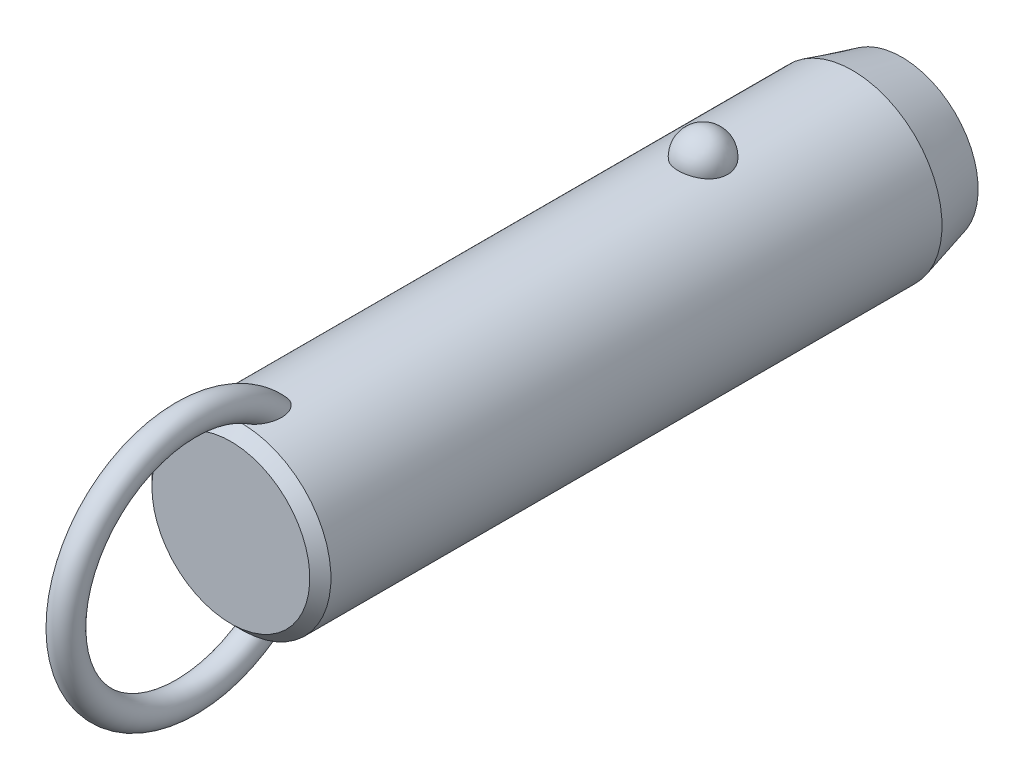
ISO-10303-21;
HEADER;
FILE_DESCRIPTION(('STEP AP214'),'2;1');
FILE_NAME('part.step','',(''),(''),'','','');
FILE_SCHEMA(('AUTOMOTIVE_DESIGN { 1 0 10303 214 1 1 1 1 }'));
ENDSEC;
DATA;
#1=APPLICATION_CONTEXT('core data for automotive mechanical design processes');
#2=APPLICATION_PROTOCOL_DEFINITION('international standard','automotive_design',2000,#1);
#3=PRODUCT_CONTEXT('',#1,'mechanical');
#4=PRODUCT('Part','Part','',(#3));
#5=PRODUCT_RELATED_PRODUCT_CATEGORY('part','',(#4));
#6=PRODUCT_DEFINITION_FORMATION('','',#4);
#7=PRODUCT_DEFINITION_CONTEXT('part definition',#1,'design');
#8=PRODUCT_DEFINITION('design','',#6,#7);
#9=PRODUCT_DEFINITION_SHAPE('','',#8);
#10=(LENGTH_UNIT() NAMED_UNIT(*) SI_UNIT(.MILLI.,.METRE.));
#11=(NAMED_UNIT(*) PLANE_ANGLE_UNIT() SI_UNIT($,.RADIAN.));
#12=(NAMED_UNIT(*) SI_UNIT($,.STERADIAN.) SOLID_ANGLE_UNIT());
#13=UNCERTAINTY_MEASURE_WITH_UNIT(LENGTH_MEASURE(1.E-05),#10,'distance_accuracy_value','');
#14=(GEOMETRIC_REPRESENTATION_CONTEXT(3) GLOBAL_UNCERTAINTY_ASSIGNED_CONTEXT((#13)) GLOBAL_UNIT_ASSIGNED_CONTEXT((#10,
#11,#12)) REPRESENTATION_CONTEXT('',''));
#15=CARTESIAN_POINT('',(0.,0.,0.));
#16=DIRECTION('',(0.,0.,1.));
#17=DIRECTION('',(1.,0.,0.));
#18=AXIS2_PLACEMENT_3D('',#15,#16,#17);
#19=CARTESIAN_POINT('',(0.,0.,50.8));
#20=DIRECTION('',(0.,0.,-1.));
#21=DIRECTION('',(-1.,0.,0.));
#22=AXIS2_PLACEMENT_3D('',#19,#20,#21);
#23=CYLINDRICAL_SURFACE('',#22,12.7);
#24=CARTESIAN_POINT('',(3.46661256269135,12.2177165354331,-3.49999999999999));
#25=CARTESIAN_POINT('',(3.4666090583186,12.2177194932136,-3.30432790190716));
#26=CARTESIAN_POINT('',(3.45063567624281,12.2222841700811,-3.10861112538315));
#27=CARTESIAN_POINT('',(3.38712451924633,12.2400345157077,-2.72271899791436));
#28=CARTESIAN_POINT('',(3.33957415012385,12.2532236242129,-2.53254588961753));
#29=CARTESIAN_POINT('',(3.2141234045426,12.286724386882,-2.16324948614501));
#30=CARTESIAN_POINT('',(3.13623639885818,12.3070329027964,-1.98412136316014));
#31=CARTESIAN_POINT('',(2.95205930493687,12.3525018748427,-1.64180592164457));
#32=CARTESIAN_POINT('',(2.84577003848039,12.3776621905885,-1.47861814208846));
#33=CARTESIAN_POINT('',(2.60688050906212,12.4301712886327,-1.17190583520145));
#34=CARTESIAN_POINT('',(2.47415697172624,12.4575299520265,-1.02847897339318));
#35=CARTESIAN_POINT('',(2.18615174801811,12.5112810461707,-0.766177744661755));
#36=CARTESIAN_POINT('',(2.03087002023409,12.5376734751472,-0.647303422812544));
#37=CARTESIAN_POINT('',(1.70237334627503,12.5864761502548,-0.437732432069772));
#38=CARTESIAN_POINT('',(1.52920948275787,12.6088972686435,-0.346958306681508));
#39=CARTESIAN_POINT('',(1.16944170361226,12.6473352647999,-0.195750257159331));
#40=CARTESIAN_POINT('',(0.982839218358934,12.663352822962,-0.135313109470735));
#41=CARTESIAN_POINT('',(0.604961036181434,12.6869706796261,-0.0473241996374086));
#42=CARTESIAN_POINT('',(0.41382314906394,12.6947125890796,-0.0192185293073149));
#43=CARTESIAN_POINT('',(0.0293827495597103,12.7014203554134,0.00517254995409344));
#44=CARTESIAN_POINT('',(-0.163919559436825,12.7003870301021,0.00146092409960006));
#45=CARTESIAN_POINT('',(-0.544374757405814,12.689735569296,-0.0373939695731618));
#46=CARTESIAN_POINT('',(-0.731575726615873,12.6802364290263,-0.0721015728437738));
#47=CARTESIAN_POINT('',(-1.09733277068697,12.6538333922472,-0.171364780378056));
#48=CARTESIAN_POINT('',(-1.27588869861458,12.6369293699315,-0.235920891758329));
#49=CARTESIAN_POINT('',(-1.6204698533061,12.5973946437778,-0.393548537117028));
#50=CARTESIAN_POINT('',(-1.78641865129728,12.5747321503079,-0.486778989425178));
#51=CARTESIAN_POINT('',(-2.10030671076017,12.5261316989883,-0.699110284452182));
#52=CARTESIAN_POINT('',(-2.24824419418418,12.5001934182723,-0.818213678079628));
#53=CARTESIAN_POINT('',(-2.52491489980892,12.4472906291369,-1.08157124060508));
#54=CARTESIAN_POINT('',(-2.65324222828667,12.4203160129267,-1.22624992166));
#55=CARTESIAN_POINT('',(-2.88410007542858,12.3687509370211,-1.53528325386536));
#56=CARTESIAN_POINT('',(-2.98662883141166,12.3441606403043,-1.69963924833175));
#57=CARTESIAN_POINT('',(-3.16432417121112,12.2998199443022,-2.04548497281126));
#58=CARTESIAN_POINT('',(-3.23917525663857,12.2801261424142,-2.22714424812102));
#59=CARTESIAN_POINT('',(-3.35800573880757,12.248167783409,-2.6009138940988));
#60=CARTESIAN_POINT('',(-3.4019860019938,12.2359030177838,-2.79302397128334));
#61=CARTESIAN_POINT('',(-3.45784812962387,12.2202347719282,-3.18140279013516));
#62=CARTESIAN_POINT('',(-3.46986123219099,12.2167950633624,-3.37765118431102));
#63=CARTESIAN_POINT('',(-3.46186273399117,12.2190638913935,-3.76943689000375));
#64=CARTESIAN_POINT('',(-3.44185196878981,12.2247721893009,-3.96497421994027));
#65=CARTESIAN_POINT('',(-3.37048652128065,12.2446381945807,-4.34881728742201));
#66=CARTESIAN_POINT('',(-3.31928253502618,12.2587552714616,-4.53715319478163));
#67=CARTESIAN_POINT('',(-3.18693461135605,12.2938237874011,-4.90231727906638));
#68=CARTESIAN_POINT('',(-3.1057895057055,12.3147754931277,-5.07914500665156));
#69=CARTESIAN_POINT('',(-2.91506431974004,12.3613125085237,-5.4173205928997));
#70=CARTESIAN_POINT('',(-2.80533587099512,12.3869217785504,-5.57858147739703));
#71=CARTESIAN_POINT('',(-2.560414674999,12.4398525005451,-5.88013283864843));
#72=CARTESIAN_POINT('',(-2.42522099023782,12.4671740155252,-6.02042254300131));
#73=CARTESIAN_POINT('',(-2.1323357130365,12.5205965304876,-6.27662798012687));
#74=CARTESIAN_POINT('',(-1.97456596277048,12.5466928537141,-6.39245542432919));
#75=CARTESIAN_POINT('',(-1.64115839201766,12.5946384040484,-6.59583547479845));
#76=CARTESIAN_POINT('',(-1.46552179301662,12.6164879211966,-6.68339001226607));
#77=CARTESIAN_POINT('',(-1.10356050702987,12.6532533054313,-6.82682153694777));
#78=CARTESIAN_POINT('',(-0.9173913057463,12.6682500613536,-6.88306988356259));
#79=CARTESIAN_POINT('',(-0.537836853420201,12.6900288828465,-6.96386887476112));
#80=CARTESIAN_POINT('',(-0.344452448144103,12.6968119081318,-6.98842322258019));
#81=CARTESIAN_POINT('',(0.0402577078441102,12.7013667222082,-7.0049646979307));
#82=CARTESIAN_POINT('',(0.231556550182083,12.6993008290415,-6.99753844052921));
#83=CARTESIAN_POINT('',(0.610105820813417,12.6867505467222,-6.95166366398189));
#84=CARTESIAN_POINT('',(0.797356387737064,12.6762664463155,-6.91321620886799));
#85=CARTESIAN_POINT('',(1.16186657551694,12.6480587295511,-6.80658431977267));
#86=CARTESIAN_POINT('',(1.33915951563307,12.6303611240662,-6.73850666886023));
#87=CARTESIAN_POINT('',(1.67968518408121,12.5896027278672,-6.57450875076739));
#88=CARTESIAN_POINT('',(1.84291705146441,12.5665416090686,-6.47858678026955));
#89=CARTESIAN_POINT('',(2.15340192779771,12.5171072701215,-6.25982455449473));
#90=CARTESIAN_POINT('',(2.30037831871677,12.4906895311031,-6.13660186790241));
#91=CARTESIAN_POINT('',(2.5717412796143,12.4376567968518,-5.86739587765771));
#92=CARTESIAN_POINT('',(2.69612388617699,12.4110417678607,-5.72140858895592));
#93=CARTESIAN_POINT('',(2.92107785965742,12.360051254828,-5.40794137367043));
#94=CARTESIAN_POINT('',(3.02121329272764,12.3357209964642,-5.24014110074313));
#95=CARTESIAN_POINT('',(3.19236291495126,12.2925446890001,-4.8896986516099));
#96=CARTESIAN_POINT('',(3.26338839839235,12.2736965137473,-4.70706226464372));
#97=CARTESIAN_POINT('',(3.36788038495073,12.245404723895,-4.35469510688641));
#98=CARTESIAN_POINT('',(3.40484026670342,12.2351018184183,-4.18605935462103));
#99=CARTESIAN_POINT('',(3.45420764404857,12.2212564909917,-3.84496058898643));
#100=CARTESIAN_POINT('',(3.46661565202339,12.2177139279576,-3.67249765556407));
#101=CARTESIAN_POINT('',(3.46661256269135,12.2177165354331,-3.49999999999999));
#102=B_SPLINE_CURVE_WITH_KNOTS('',3,(#24,#25,#26,#27,#28,#29,#30,#31,#32,#33,#34,#35,#36,#37,
#38,#39,#40,#41,#42,#43,#44,#45,#46,#47,#48,#49,#50,#51,#52,#53,#54,#55,#56,#57,#58,#59,#60,#61,
#62,#63,#64,#65,#66,#67,#68,#69,#70,#71,#72,#73,#74,#75,#76,#77,#78,#79,#80,#81,#82,#83,#84,#85,
#86,#87,#88,#89,#90,#91,#92,#93,#94,#95,#96,#97,#98,#99,#100,#101),.UNSPECIFIED.,.T.,.F.,(4,2,2,
2,2,2,2,2,2,2,2,2,2,2,2,2,2,2,2,2,2,2,2,2,2,2,2,2,2,2,2,2,2,2,2,2,2,2,4),(0.,0.586396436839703,
1.17302689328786,1.7593990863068,2.34575431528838,2.93491084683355,3.52406845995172,
4.11158733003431,4.69904375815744,5.2762784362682,5.85345931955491,6.42265312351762,
6.99185659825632,7.56427334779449,8.136746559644,8.71981013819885,9.3029135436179,
9.89247258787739,10.4820150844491,11.0691335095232,11.6562366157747,12.2405256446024,
12.8248374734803,13.412244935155,13.9996740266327,14.5891883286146,15.1786623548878,
15.7609861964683,16.3432419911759,16.9148635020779,17.4864654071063,18.0560241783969,
18.6256177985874,19.2037609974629,19.7820055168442,20.3699810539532,20.957728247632,
21.4746855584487,21.9916320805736),.UNSPECIFIED.);
#103=CARTESIAN_POINT('',(3.46661256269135,12.2177165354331,-3.49999999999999));
#104=VERTEX_POINT('',#103);
#105=EDGE_CURVE('E41',#104,#104,#102,.T.);
#106=ORIENTED_EDGE('',*,*,#105,.T.);
#107=EDGE_LOOP('',(#106));
#108=FACE_BOUND('',#107,.T.);
#109=CARTESIAN_POINT('',(0.,0.,62.));
#110=DIRECTION('',(0.,0.,1.));
#111=DIRECTION('',(1.,0.,0.));
#112=AXIS2_PLACEMENT_3D('',#109,#110,#111);
#113=CIRCLE('',#112,12.7);
#114=CARTESIAN_POINT('',(-12.7,0.,62.));
#115=VERTEX_POINT('',#114);
#116=EDGE_CURVE('E10',#115,#115,#113,.F.);
#117=ORIENTED_EDGE('',*,*,#116,.T.);
#118=EDGE_LOOP('',(#117));
#119=FACE_BOUND('',#118,.T.);
#120=CARTESIAN_POINT('',(-0.54812224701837,-12.6881662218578,55.7432187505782));
#121=CARTESIAN_POINT('',(-0.648865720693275,-12.6838128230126,55.777926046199));
#122=CARTESIAN_POINT('',(-0.746398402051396,-12.6783867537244,55.8220428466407));
#123=CARTESIAN_POINT('',(-0.932125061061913,-12.666091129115,55.9267647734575));
#124=CARTESIAN_POINT('',(-1.02030388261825,-12.6592192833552,55.987396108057));
#125=CARTESIAN_POINT('',(-1.18487740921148,-12.6448747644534,56.121847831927));
#126=CARTESIAN_POINT('',(-1.26134296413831,-12.637406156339,56.1955825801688));
#127=CARTESIAN_POINT('',(-1.4023120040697,-12.6225412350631,56.3536045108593));
#128=CARTESIAN_POINT('',(-1.46681470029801,-12.6151449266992,56.4378923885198));
#129=CARTESIAN_POINT('',(-1.60714786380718,-12.5981718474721,56.6496577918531));
#130=CARTESIAN_POINT('',(-1.67725126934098,-12.588900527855,56.7809624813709));
#131=CARTESIAN_POINT('',(-1.79536591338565,-12.5725964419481,57.0532471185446));
#132=CARTESIAN_POINT('',(-1.84333535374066,-12.5655679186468,57.1942447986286));
#133=CARTESIAN_POINT('',(-1.93422576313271,-12.5519624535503,57.5376455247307));
#134=CARTESIAN_POINT('',(-1.96788773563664,-12.5466298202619,57.7425578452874));
#135=CARTESIAN_POINT('',(-1.9941399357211,-12.542463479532,58.0517600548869));
#136=CARTESIAN_POINT('',(-1.99883864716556,-12.5417153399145,58.1552987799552));
#137=CARTESIAN_POINT('',(-2.00078003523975,-12.5414074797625,58.3624512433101));
#138=CARTESIAN_POINT('',(-1.99802449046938,-12.5418474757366,58.4660649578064));
#139=CARTESIAN_POINT('',(-1.98336733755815,-12.5441750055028,58.7103207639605));
#140=CARTESIAN_POINT('',(-1.96851430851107,-12.5465291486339,58.850780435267));
#141=CARTESIAN_POINT('',(-1.92707089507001,-12.5529612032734,59.1299607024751));
#142=CARTESIAN_POINT('',(-1.900474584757,-12.5570399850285,59.2686803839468));
#143=CARTESIAN_POINT('',(-1.83619120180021,-12.5666008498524,59.5434113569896));
#144=CARTESIAN_POINT('',(-1.79850828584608,-12.57208240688,59.6794236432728));
#145=CARTESIAN_POINT('',(-1.71223796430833,-12.5841228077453,59.9478421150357));
#146=CARTESIAN_POINT('',(-1.66365679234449,-12.5906810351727,60.0802503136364));
#147=CARTESIAN_POINT('',(-1.57804503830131,-12.6016176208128,60.2854887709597));
#148=CARTESIAN_POINT('',(-1.54477252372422,-12.6057501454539,60.3599149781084));
#149=CARTESIAN_POINT('',(-1.47424480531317,-12.6141930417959,60.5068393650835));
#150=CARTESIAN_POINT('',(-1.43699041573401,-12.6185033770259,60.5793379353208));
#151=CARTESIAN_POINT('',(-1.35825795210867,-12.6272207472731,60.7218926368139));
#152=CARTESIAN_POINT('',(-1.31678520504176,-12.6316276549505,60.7919517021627));
#153=CARTESIAN_POINT('',(-1.22917793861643,-12.6404532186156,60.9290705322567));
#154=CARTESIAN_POINT('',(-1.18304514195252,-12.6448718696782,60.9961313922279));
#155=CARTESIAN_POINT('',(-1.07246411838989,-12.6547893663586,61.1438741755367));
#156=CARTESIAN_POINT('',(-1.00642239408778,-12.6602600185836,61.2233844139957));
#157=CARTESIAN_POINT('',(-0.864441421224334,-12.6707460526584,61.3731698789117));
#158=CARTESIAN_POINT('',(-0.788516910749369,-12.6757620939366,61.4434585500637));
#159=CARTESIAN_POINT('',(-0.652215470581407,-12.6833591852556,61.5486801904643));
#160=CARTESIAN_POINT('',(-0.594982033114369,-12.6861973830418,61.5876241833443));
#161=CARTESIAN_POINT('',(-0.475269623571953,-12.6912445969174,61.6564899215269));
#162=CARTESIAN_POINT('',(-0.412800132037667,-12.6934547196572,61.6864275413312));
#163=CARTESIAN_POINT('',(-0.295749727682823,-12.6966636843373,61.7297565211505));
#164=CARTESIAN_POINT('',(-0.241949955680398,-12.6978134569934,61.7452188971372));
#165=CARTESIAN_POINT('',(-0.132508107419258,-12.6994261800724,61.7668845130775));
#166=CARTESIAN_POINT('',(-0.0768679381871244,-12.6998898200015,61.7730970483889));
#167=CARTESIAN_POINT('',(0.0347696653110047,-12.7000752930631,61.7755838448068));
#168=CARTESIAN_POINT('',(0.0907676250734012,-12.6997954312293,61.7718353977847));
#169=CARTESIAN_POINT('',(0.201283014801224,-12.6985255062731,61.7547883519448));
#170=CARTESIAN_POINT('',(0.255799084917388,-12.6975348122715,61.7414812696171));
#171=CARTESIAN_POINT('',(0.376042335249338,-12.6946091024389,61.7020379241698));
#172=CARTESIAN_POINT('',(0.440950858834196,-12.6924943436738,61.6734492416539));
#173=CARTESIAN_POINT('',(0.565350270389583,-12.6875639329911,61.6063234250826));
#174=CARTESIAN_POINT('',(0.624828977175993,-12.6847467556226,61.5677646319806));
#175=CARTESIAN_POINT('',(0.774116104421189,-12.6767252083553,61.456949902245));
#176=CARTESIAN_POINT('',(0.859449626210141,-12.6711344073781,61.3787605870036));
#177=CARTESIAN_POINT('',(1.01789440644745,-12.6593922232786,61.210943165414));
#178=CARTESIAN_POINT('',(1.09096902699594,-12.653239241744,61.121282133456));
#179=CARTESIAN_POINT('',(1.22268793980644,-12.6411674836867,60.9402658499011));
#180=CARTESIAN_POINT('',(1.28193986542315,-12.6352572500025,60.849345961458));
#181=CARTESIAN_POINT('',(1.39259777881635,-12.6235401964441,60.6627929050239));
#182=CARTESIAN_POINT('',(1.44399707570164,-12.6177334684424,60.5671558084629));
#183=CARTESIAN_POINT('',(1.53972870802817,-12.6064093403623,60.3722738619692));
#184=CARTESIAN_POINT('',(1.58405262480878,-12.6008922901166,60.2730248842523));
#185=CARTESIAN_POINT('',(1.66600705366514,-12.5903187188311,60.0717727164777));
#186=CARTESIAN_POINT('',(1.70363651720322,-12.5852622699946,59.9697690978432));
#187=CARTESIAN_POINT('',(1.7754537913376,-12.5753406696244,59.7543580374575));
#188=CARTESIAN_POINT('',(1.80903453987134,-12.5705328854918,59.6407454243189));
#189=CARTESIAN_POINT('',(1.86844163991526,-12.5618400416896,59.4114575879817));
#190=CARTESIAN_POINT('',(1.89426665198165,-12.5579551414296,59.2957820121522));
#191=CARTESIAN_POINT('',(1.93785464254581,-12.5513030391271,59.0630072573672));
#192=CARTESIAN_POINT('',(1.95562640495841,-12.5485346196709,58.9459097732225));
#193=CARTESIAN_POINT('',(1.98264463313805,-12.5442934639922,58.7107473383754));
#194=CARTESIAN_POINT('',(1.99189298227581,-12.5428204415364,58.5926826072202));
#195=CARTESIAN_POINT('',(2.00416068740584,-12.540871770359,58.2806225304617));
#196=CARTESIAN_POINT('',(1.99944433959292,-12.541631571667,58.086229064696));
#197=CARTESIAN_POINT('',(1.96113755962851,-12.5476846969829,57.7003095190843));
#198=CARTESIAN_POINT('',(1.92758341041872,-12.5529723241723,57.5087801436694));
#199=CARTESIAN_POINT('',(1.83934342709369,-12.5661532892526,57.1822728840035));
#200=CARTESIAN_POINT('',(1.79215440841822,-12.5730485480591,57.0452499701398));
#201=CARTESIAN_POINT('',(1.67676242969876,-12.588958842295,56.7804459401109));
#202=CARTESIAN_POINT('',(1.60859050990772,-12.597970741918,56.6526515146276));
#203=CARTESIAN_POINT('',(1.4658383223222,-12.6152829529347,56.4358006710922));
#204=CARTESIAN_POINT('',(1.39525727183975,-12.6233659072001,56.3441050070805));
#205=CARTESIAN_POINT('',(1.2399259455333,-12.6395676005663,56.1734854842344));
#206=CARTESIAN_POINT('',(1.15517932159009,-12.6476863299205,56.0945583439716));
#207=CARTESIAN_POINT('',(0.971995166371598,-12.6630846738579,55.9526438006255));
#208=CARTESIAN_POINT('',(0.873456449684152,-12.6703572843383,55.889784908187));
#209=CARTESIAN_POINT('',(0.665847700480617,-12.6829569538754,55.7844870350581));
#210=CARTESIAN_POINT('',(0.55678457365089,-12.688285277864,55.7420347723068));
#211=CARTESIAN_POINT('',(0.347338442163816,-12.6956226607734,55.6844434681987));
#212=CARTESIAN_POINT('',(0.247759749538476,-12.6979816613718,55.6663996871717));
#213=CARTESIAN_POINT('',(0.0470218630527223,-12.7003077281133,55.6486007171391));
#214=CARTESIAN_POINT('',(-0.054135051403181,-12.7002779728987,55.6488212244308));
#215=CARTESIAN_POINT('',(-0.221414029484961,-12.6982482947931,55.6643639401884));
#216=CARTESIAN_POINT('',(-0.288055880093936,-12.6969033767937,55.6746662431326));
#217=CARTESIAN_POINT('',(-0.419599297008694,-12.6932369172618,55.7031348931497));
#218=CARTESIAN_POINT('',(-0.484501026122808,-12.6909154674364,55.7213005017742));
#219=CARTESIAN_POINT('',(-0.54812224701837,-12.6881662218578,55.7432187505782));
#220=B_SPLINE_CURVE_WITH_KNOTS('',3,(#120,#121,#122,#123,#124,#125,#126,#127,#128,#129,#130,
#131,#132,#133,#134,#135,#136,#137,#138,#139,#140,#141,#142,#143,#144,#145,#146,#147,#148,#149,
#150,#151,#152,#153,#154,#155,#156,#157,#158,#159,#160,#161,#162,#163,#164,#165,#166,#167,#168,
#169,#170,#171,#172,#173,#174,#175,#176,#177,#178,#179,#180,#181,#182,#183,#184,#185,#186,#187,
#188,#189,#190,#191,#192,#193,#194,#195,#196,#197,#198,#199,#200,#201,#202,#203,#204,#205,#206,
#207,#208,#209,#210,#211,#212,#213,#214,#215,#216,#217,#218,#219),.UNSPECIFIED.,.T.,.F.,(4,2,2,
2,2,2,2,2,2,2,2,2,2,2,2,2,2,2,2,2,2,2,2,2,2,2,2,2,2,2,2,2,2,2,2,2,2,2,2,2,2,2,2,2,2,2,2,2,2,4),
(0.,0.319642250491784,0.639794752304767,0.957927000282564,1.27608021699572,1.72100165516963,
2.16675988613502,2.78630021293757,3.09705782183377,3.40774128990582,3.83096358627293,
4.25439969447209,4.67767724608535,5.10071330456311,5.34550297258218,5.59024267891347,
5.8346770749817,6.07902143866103,6.38891080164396,6.69834321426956,6.90560910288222,
7.11250749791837,7.27977315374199,7.44687060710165,7.6143493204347,7.78197685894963,
7.99365544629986,8.20579780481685,8.551473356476,8.89816429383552,9.22375138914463,
9.54961437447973,9.87586224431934,10.202161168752,10.5575872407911,10.9130746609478,
11.2681734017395,11.6231936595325,12.2046601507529,12.7853961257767,13.219164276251,
13.6522938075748,13.9989174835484,14.3454519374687,14.6946768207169,15.0436740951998,
15.3457513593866,15.6474266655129,15.8493051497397,16.0511646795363),.UNSPECIFIED.);
#221=CARTESIAN_POINT('',(-0.54812224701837,-12.6881662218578,55.7432187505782));
#222=VERTEX_POINT('',#221);
#223=EDGE_CURVE('E60',#222,#222,#220,.T.);
#224=ORIENTED_EDGE('',*,*,#223,.T.);
#225=EDGE_LOOP('',(#224));
#226=FACE_BOUND('',#225,.T.);
#227=CARTESIAN_POINT('',(-0.54812224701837,12.6881662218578,55.7432187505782));
#228=CARTESIAN_POINT('',(-0.459436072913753,12.6919968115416,55.712673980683));
#229=CARTESIAN_POINT('',(-0.368189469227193,12.6949996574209,55.6893913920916));
#230=CARTESIAN_POINT('',(-0.183024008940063,12.6990186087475,55.6584062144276));
#231=CARTESIAN_POINT('',(-0.0891049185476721,12.7000345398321,55.6507049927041));
#232=CARTESIAN_POINT('',(0.098714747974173,12.6999636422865,55.6512455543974));
#233=CARTESIAN_POINT('',(0.192615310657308,12.6988761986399,55.6594920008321));
#234=CARTESIAN_POINT('',(0.377658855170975,12.6947211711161,55.6915515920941));
#235=CARTESIAN_POINT('',(0.468801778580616,12.6916535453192,55.7153650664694));
#236=CARTESIAN_POINT('',(0.645809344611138,12.6838788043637,55.7774565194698));
#237=CARTESIAN_POINT('',(0.731679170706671,12.6791733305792,55.815720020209));
#238=CARTESIAN_POINT('',(0.896315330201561,12.6686004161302,55.905120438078));
#239=CARTESIAN_POINT('',(0.975080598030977,12.6627328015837,55.9562592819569));
#240=CARTESIAN_POINT('',(1.12963655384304,12.6499161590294,56.0736782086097));
#241=CARTESIAN_POINT('',(1.20478673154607,12.6429194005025,56.1407929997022));
#242=CARTESIAN_POINT('',(1.34448241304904,12.6288282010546,56.2852250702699));
#243=CARTESIAN_POINT('',(1.40902173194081,12.621733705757,56.3625482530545));
#244=CARTESIAN_POINT('',(1.55208211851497,12.6050877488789,56.5592475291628));
#245=CARTESIAN_POINT('',(1.62510490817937,12.5957546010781,56.6826540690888));
#246=CARTESIAN_POINT('',(1.7501904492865,12.5789823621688,56.9397690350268));
#247=CARTESIAN_POINT('',(1.80221377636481,12.5715468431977,57.073496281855));
#248=CARTESIAN_POINT('',(1.90309965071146,12.5567434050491,57.3983516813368));
#249=CARTESIAN_POINT('',(1.94342317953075,12.5504515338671,57.5921611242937));
#250=CARTESIAN_POINT('',(1.99332997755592,12.5426147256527,57.9837881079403));
#251=CARTESIAN_POINT('',(2.00285305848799,12.5410790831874,58.1816127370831));
#252=CARTESIAN_POINT('',(1.99678999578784,12.5420407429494,58.5166427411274));
#253=CARTESIAN_POINT('',(1.98794117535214,12.5434564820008,58.6540428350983));
#254=CARTESIAN_POINT('',(1.95865119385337,12.5480641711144,58.9276394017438));
#255=CARTESIAN_POINT('',(1.9382043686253,12.5512569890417,59.0638352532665));
#256=CARTESIAN_POINT('',(1.88647896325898,12.5591352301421,59.3342493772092));
#257=CARTESIAN_POINT('',(1.85518800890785,12.5638223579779,59.4684652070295));
#258=CARTESIAN_POINT('',(1.78217886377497,12.5743868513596,59.7339362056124));
#259=CARTESIAN_POINT('',(1.74046509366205,12.5802637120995,59.8651926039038));
#260=CARTESIAN_POINT('',(1.66024095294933,12.5910571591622,60.0860855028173));
#261=CARTESIAN_POINT('',(1.62434772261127,12.5957535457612,60.1766904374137));
#262=CARTESIAN_POINT('',(1.5470900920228,12.6054762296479,60.3555125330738));
#263=CARTESIAN_POINT('',(1.50572681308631,12.6105024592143,60.4437301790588));
#264=CARTESIAN_POINT('',(1.41728020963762,12.620748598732,60.6169321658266));
#265=CARTESIAN_POINT('',(1.37021377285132,12.625967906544,60.7019251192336));
#266=CARTESIAN_POINT('',(1.2696962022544,12.6364721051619,60.8680072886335));
#267=CARTESIAN_POINT('',(1.21624929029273,12.6417569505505,60.9490990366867));
#268=CARTESIAN_POINT('',(1.10304413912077,12.6521331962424,61.1047027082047));
#269=CARTESIAN_POINT('',(1.04340936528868,12.657226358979,61.1793033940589));
#270=CARTESIAN_POINT('',(0.915919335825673,12.6670906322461,61.321324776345));
#271=CARTESIAN_POINT('',(0.848064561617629,12.6718617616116,61.3887458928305));
#272=CARTESIAN_POINT('',(0.717035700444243,12.67987711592,61.5006247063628));
#273=CARTESIAN_POINT('',(0.655526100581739,12.6832377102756,61.5469970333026));
#274=CARTESIAN_POINT('',(0.525985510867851,12.6892676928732,61.6296195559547));
#275=CARTESIAN_POINT('',(0.457969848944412,12.6919386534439,61.6658927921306));
#276=CARTESIAN_POINT('',(0.33485964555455,12.695691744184,61.7166572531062));
#277=CARTESIAN_POINT('',(0.281116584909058,12.6970073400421,61.7343733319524));
#278=CARTESIAN_POINT('',(0.171425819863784,12.6989609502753,61.7606429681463));
#279=CARTESIAN_POINT('',(0.115480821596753,12.699599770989,61.7692074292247));
#280=CARTESIAN_POINT('',(0.0027261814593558,12.7001251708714,61.7762531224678));
#281=CARTESIAN_POINT('',(-0.054085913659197,12.7000089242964,61.7746964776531));
#282=CARTESIAN_POINT('',(-0.166544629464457,12.6990328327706,61.7616005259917));
#283=CARTESIAN_POINT('',(-0.22219029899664,12.6981724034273,61.7500533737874));
#284=CARTESIAN_POINT('',(-0.342018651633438,12.695562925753,61.7149128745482));
#285=CARTESIAN_POINT('',(-0.405606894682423,12.6936676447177,61.6893322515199));
#286=CARTESIAN_POINT('',(-0.527815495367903,12.6891754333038,61.6283111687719));
#287=CARTESIAN_POINT('',(-0.586425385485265,12.6865770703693,61.5928505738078));
#288=CARTESIAN_POINT('',(-0.731842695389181,12.6792129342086,61.4914960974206));
#289=CARTESIAN_POINT('',(-0.814709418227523,12.6740767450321,61.4200395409));
#290=CARTESIAN_POINT('',(-0.969101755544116,12.6632083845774,61.2658900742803));
#291=CARTESIAN_POINT('',(-1.04059564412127,12.6574746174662,61.1831668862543));
#292=CARTESIAN_POINT('',(-1.1698111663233,12.6461638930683,61.0158096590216));
#293=CARTESIAN_POINT('',(-1.2281136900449,12.6405994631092,60.9316166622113));
#294=CARTESIAN_POINT('',(-1.33743405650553,12.6295007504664,60.7585791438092));
#295=CARTESIAN_POINT('',(-1.38844577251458,12.6239664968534,60.6697307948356));
#296=CARTESIAN_POINT('',(-1.48400702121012,12.6130898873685,60.4883895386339));
#297=CARTESIAN_POINT('',(-1.52854232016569,12.6077479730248,60.3958891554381));
#298=CARTESIAN_POINT('',(-1.61150113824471,12.5974127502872,60.2081607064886));
#299=CARTESIAN_POINT('',(-1.64992317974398,12.5924195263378,60.1129319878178));
#300=CARTESIAN_POINT('',(-1.73468589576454,12.581070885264,59.8828936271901));
#301=CARTESIAN_POINT('',(-1.77831261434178,12.5749388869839,59.7470661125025));
#302=CARTESIAN_POINT('',(-1.85439734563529,12.5639437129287,59.4722128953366));
#303=CARTESIAN_POINT('',(-1.88684994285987,12.5590811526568,59.3331856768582));
#304=CARTESIAN_POINT('',(-1.9400848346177,12.550968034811,59.0530923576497));
#305=CARTESIAN_POINT('',(-1.96088706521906,12.5477147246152,58.9120301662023));
#306=CARTESIAN_POINT('',(-1.99000539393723,12.5431291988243,58.6286689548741));
#307=CARTESIAN_POINT('',(-1.99832911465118,12.5417958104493,58.4863707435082));
#308=CARTESIAN_POINT('',(-2.00166624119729,12.5412674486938,58.1576271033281));
#309=CARTESIAN_POINT('',(-1.99178843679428,12.5428579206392,57.971088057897));
#310=CARTESIAN_POINT('',(-1.94455183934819,12.5502731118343,57.6016240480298));
#311=CARTESIAN_POINT('',(-1.90724032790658,12.5560905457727,57.4186934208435));
#312=CARTESIAN_POINT('',(-1.81330718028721,12.5699462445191,57.1048488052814));
#313=CARTESIAN_POINT('',(-1.76338820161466,12.5771273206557,56.9719105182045));
#314=CARTESIAN_POINT('',(-1.6430501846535,12.593414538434,56.7156813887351));
#315=CARTESIAN_POINT('',(-1.57265346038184,12.6025185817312,56.592380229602));
#316=CARTESIAN_POINT('',(-1.42634956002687,12.6198178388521,56.3835648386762));
#317=CARTESIAN_POINT('',(-1.35423772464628,12.6278405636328,56.2953846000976));
#318=CARTESIAN_POINT('',(-1.19645664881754,12.6437632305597,56.1321079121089));
#319=CARTESIAN_POINT('',(-1.11080536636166,12.6516633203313,56.0569944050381));
#320=CARTESIAN_POINT('',(-0.947219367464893,12.6648319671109,55.9378114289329));
#321=CARTESIAN_POINT('',(-0.871624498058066,12.670300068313,55.8905414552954));
#322=CARTESIAN_POINT('',(-0.71416188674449,12.6801492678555,55.8077413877));
#323=CARTESIAN_POINT('',(-0.6322953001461,12.684530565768,55.7722091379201));
#324=CARTESIAN_POINT('',(-0.54812224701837,12.6881662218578,55.7432187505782));
#325=B_SPLINE_CURVE_WITH_KNOTS('',3,(#227,#228,#229,#230,#231,#232,#233,#234,#235,#236,#237,
#238,#239,#240,#241,#242,#243,#244,#245,#246,#247,#248,#249,#250,#251,#252,#253,#254,#255,#256,
#257,#258,#259,#260,#261,#262,#263,#264,#265,#266,#267,#268,#269,#270,#271,#272,#273,#274,#275,
#276,#277,#278,#279,#280,#281,#282,#283,#284,#285,#286,#287,#288,#289,#290,#291,#292,#293,#294,
#295,#296,#297,#298,#299,#300,#301,#302,#303,#304,#305,#306,#307,#308,#309,#310,#311,#312,#313,
#314,#315,#316,#317,#318,#319,#320,#321,#322,#323,#324),.UNSPECIFIED.,.T.,.F.,(4,2,2,2,2,2,2,2,
2,2,2,2,2,2,2,2,2,2,2,2,2,2,2,2,2,2,2,2,2,2,2,2,2,2,2,2,2,2,2,2,2,2,2,2,2,2,2,2,4),(0.,
0.281328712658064,0.562682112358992,0.844117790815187,1.12555942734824,1.40671982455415,
1.68792232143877,1.98972294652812,2.2916988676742,2.72039860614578,3.14989948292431,
3.7408491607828,4.33295293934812,4.74554109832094,5.15833092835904,5.57159335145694,
5.98468079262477,6.27722775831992,6.56971484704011,6.86135609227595,7.1528054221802,
7.43927407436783,7.72572595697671,7.9563586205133,8.18646071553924,8.35559393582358,
8.52452541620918,8.69408946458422,8.86378678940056,9.06834348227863,9.27332014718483,
9.60010414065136,9.9277843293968,10.2350252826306,10.5425229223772,10.8506864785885,
11.1589244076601,11.5867893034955,12.0148612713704,12.4421984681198,12.8692745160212,
13.4279365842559,13.9856380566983,14.4107062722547,14.8353130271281,15.1765567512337,
15.5173516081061,15.7844129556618,16.051425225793),.UNSPECIFIED.);
#326=CARTESIAN_POINT('',(-0.54812224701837,12.6881662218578,55.7432187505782));
#327=VERTEX_POINT('',#326);
#328=EDGE_CURVE('E67',#327,#327,#325,.T.);
#329=ORIENTED_EDGE('',*,*,#328,.T.);
#330=EDGE_LOOP('',(#329));
#331=FACE_BOUND('',#330,.T.);
#332=CARTESIAN_POINT('',(0.,0.,-24.6999999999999));
#333=DIRECTION('',(0.,0.,-1.));
#334=DIRECTION('',(-1.,0.,0.));
#335=AXIS2_PLACEMENT_3D('',#332,#333,#334);
#336=CIRCLE('',#335,12.7);
#337=CARTESIAN_POINT('',(-12.7,0.,-24.6999999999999));
#338=VERTEX_POINT('',#337);
#339=EDGE_CURVE('E57',#338,#338,#336,.F.);
#340=ORIENTED_EDGE('',*,*,#339,.T.);
#341=EDGE_LOOP('',(#340));
#342=FACE_BOUND('',#341,.T.);
#343=ADVANCED_FACE('F37',(#108,#119,#226,#331,#342),#23,.T.);
#344=CARTESIAN_POINT('',(0.,0.,-31.7));
#345=DIRECTION('',(0.,0.,-1.));
#346=DIRECTION('',(-1.,0.,0.));
#347=AXIS2_PLACEMENT_3D('',#344,#345,#346);
#348=PLANE('',#347);
#349=CARTESIAN_POINT('',(0.,0.,-31.7));
#350=DIRECTION('',(0.,0.,-1.));
#351=DIRECTION('',(-1.,0.,0.));
#352=AXIS2_PLACEMENT_3D('',#349,#350,#351);
#353=CIRCLE('',#352,10.8243556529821);
#354=CARTESIAN_POINT('',(-10.8243556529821,0.,-31.7));
#355=VERTEX_POINT('',#354);
#356=EDGE_CURVE('E66',#355,#355,#353,.T.);
#357=ORIENTED_EDGE('',*,*,#356,.T.);
#358=EDGE_LOOP('',(#357));
#359=FACE_BOUND('',#358,.T.);
#360=ADVANCED_FACE('F85',(#359),#348,.T.);
#361=CARTESIAN_POINT('',(0.,0.,-31.7));
#362=DIRECTION('',(0.,0.,1.));
#363=DIRECTION('',(1.,0.,0.));
#364=AXIS2_PLACEMENT_3D('',#361,#362,#363);
#365=CONICAL_SURFACE('',#364,10.8243556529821,0.261799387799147);
#366=ORIENTED_EDGE('',*,*,#339,.F.);
#367=EDGE_LOOP('',(#366));
#368=FACE_BOUND('',#367,.T.);
#369=ORIENTED_EDGE('',*,*,#356,.F.);
#370=EDGE_LOOP('',(#369));
#371=FACE_BOUND('',#370,.T.);
#372=ADVANCED_FACE('F83',(#368,#371),#365,.T.);
#373=CARTESIAN_POINT('',(0.,0.,63.5));
#374=DIRECTION('',(0.,0.,1.));
#375=DIRECTION('',(1.,0.,0.));
#376=AXIS2_PLACEMENT_3D('',#373,#374,#375);
#377=PLANE('',#376);
#378=CARTESIAN_POINT('',(0.,0.,63.5));
#379=DIRECTION('',(0.,0.,1.));
#380=DIRECTION('',(1.,0.,0.));
#381=AXIS2_PLACEMENT_3D('',#378,#379,#380);
#382=CIRCLE('',#381,11.2);
#383=CARTESIAN_POINT('',(-11.2,0.,63.5));
#384=VERTEX_POINT('',#383);
#385=EDGE_CURVE('E50',#384,#384,#382,.T.);
#386=ORIENTED_EDGE('',*,*,#385,.T.);
#387=EDGE_LOOP('',(#386));
#388=FACE_BOUND('',#387,.T.);
#389=ADVANCED_FACE('F77',(#388),#377,.T.);
#390=CARTESIAN_POINT('',(0.,0.,69.85));
#391=DIRECTION('',(1.,0.,0.));
#392=DIRECTION('',(0.,0.,-1.));
#393=AXIS2_PLACEMENT_3D('',#390,#391,#392);
#394=TOROIDAL_SURFACE('',#393,17.05,2.);
#395=ORIENTED_EDGE('',*,*,#328,.F.);
#396=EDGE_LOOP('',(#395));
#397=FACE_BOUND('',#396,.T.);
#398=ORIENTED_EDGE('',*,*,#223,.F.);
#399=EDGE_LOOP('',(#398));
#400=FACE_BOUND('',#399,.T.);
#401=ADVANCED_FACE('F73',(#397,#400),#394,.T.);
#402=CARTESIAN_POINT('',(0.,0.,63.5));
#403=DIRECTION('',(0.,0.,-1.));
#404=DIRECTION('',(-1.,0.,0.));
#405=AXIS2_PLACEMENT_3D('',#402,#403,#404);
#406=CONICAL_SURFACE('',#405,11.2,0.785398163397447);
#407=CARTESIAN_POINT('',(-12.7,0.,62.));
#408=CARTESIAN_POINT('',(-12.684375,0.,62.015625));
#409=CARTESIAN_POINT('',(-12.66875,0.,62.03125));
#410=CARTESIAN_POINT('',(-12.6375,0.,62.0625));
#411=CARTESIAN_POINT('',(-12.621875,0.,62.078125));
#412=CARTESIAN_POINT('',(-12.590625,0.,62.109375));
#413=CARTESIAN_POINT('',(-12.575,0.,62.125));
#414=CARTESIAN_POINT('',(-12.54375,0.,62.15625));
#415=CARTESIAN_POINT('',(-12.528125,0.,62.171875));
#416=CARTESIAN_POINT('',(-12.496875,0.,62.203125));
#417=CARTESIAN_POINT('',(-12.48125,0.,62.21875));
#418=CARTESIAN_POINT('',(-12.45,0.,62.25));
#419=CARTESIAN_POINT('',(-12.434375,0.,62.265625));
#420=CARTESIAN_POINT('',(-12.403125,0.,62.296875));
#421=CARTESIAN_POINT('',(-12.3875,0.,62.3125));
#422=CARTESIAN_POINT('',(-12.35625,0.,62.34375));
#423=CARTESIAN_POINT('',(-12.340625,0.,62.359375));
#424=CARTESIAN_POINT('',(-12.309375,0.,62.390625));
#425=CARTESIAN_POINT('',(-12.29375,0.,62.40625));
#426=CARTESIAN_POINT('',(-12.2625,0.,62.4375));
#427=CARTESIAN_POINT('',(-12.246875,0.,62.453125));
#428=CARTESIAN_POINT('',(-12.215625,0.,62.484375));
#429=CARTESIAN_POINT('',(-12.2,0.,62.5));
#430=CARTESIAN_POINT('',(-12.16875,0.,62.53125));
#431=CARTESIAN_POINT('',(-12.153125,0.,62.546875));
#432=CARTESIAN_POINT('',(-12.121875,0.,62.578125));
#433=CARTESIAN_POINT('',(-12.10625,0.,62.59375));
#434=CARTESIAN_POINT('',(-12.075,0.,62.625));
#435=CARTESIAN_POINT('',(-12.059375,0.,62.640625));
#436=CARTESIAN_POINT('',(-12.028125,0.,62.671875));
#437=CARTESIAN_POINT('',(-12.0125,0.,62.6875));
#438=CARTESIAN_POINT('',(-11.98125,0.,62.71875));
#439=CARTESIAN_POINT('',(-11.965625,0.,62.734375));
#440=CARTESIAN_POINT('',(-11.934375,0.,62.765625));
#441=CARTESIAN_POINT('',(-11.91875,0.,62.78125));
#442=CARTESIAN_POINT('',(-11.8875,0.,62.8125));
#443=CARTESIAN_POINT('',(-11.871875,0.,62.828125));
#444=CARTESIAN_POINT('',(-11.840625,0.,62.859375));
#445=CARTESIAN_POINT('',(-11.825,0.,62.875));
#446=CARTESIAN_POINT('',(-11.79375,0.,62.90625));
#447=CARTESIAN_POINT('',(-11.778125,0.,62.921875));
#448=CARTESIAN_POINT('',(-11.746875,0.,62.953125));
#449=CARTESIAN_POINT('',(-11.73125,0.,62.96875));
#450=CARTESIAN_POINT('',(-11.7,0.,63.));
#451=CARTESIAN_POINT('',(-11.684375,0.,63.015625));
#452=CARTESIAN_POINT('',(-11.653125,0.,63.046875));
#453=CARTESIAN_POINT('',(-11.6375,0.,63.0625));
#454=CARTESIAN_POINT('',(-11.60625,0.,63.09375));
#455=CARTESIAN_POINT('',(-11.590625,0.,63.109375));
#456=CARTESIAN_POINT('',(-11.559375,0.,63.140625));
#457=CARTESIAN_POINT('',(-11.54375,0.,63.15625));
#458=CARTESIAN_POINT('',(-11.5125,0.,63.1875));
#459=CARTESIAN_POINT('',(-11.496875,0.,63.203125));
#460=CARTESIAN_POINT('',(-11.465625,0.,63.234375));
#461=CARTESIAN_POINT('',(-11.45,0.,63.25));
#462=CARTESIAN_POINT('',(-11.41875,0.,63.28125));
#463=CARTESIAN_POINT('',(-11.403125,0.,63.296875));
#464=CARTESIAN_POINT('',(-11.371875,0.,63.328125));
#465=CARTESIAN_POINT('',(-11.35625,0.,63.34375));
#466=CARTESIAN_POINT('',(-11.325,0.,63.375));
#467=CARTESIAN_POINT('',(-11.309375,0.,63.390625));
#468=CARTESIAN_POINT('',(-11.278125,0.,63.421875));
#469=CARTESIAN_POINT('',(-11.2625,0.,63.4375));
#470=CARTESIAN_POINT('',(-11.23125,0.,63.46875));
#471=CARTESIAN_POINT('',(-11.215625,0.,63.484375));
#472=CARTESIAN_POINT('',(-11.2,0.,63.5));
#473=B_SPLINE_CURVE_WITH_KNOTS('',3,(#407,#408,#409,#410,#411,#412,#413,#414,#415,#416,#417,
#418,#419,#420,#421,#422,#423,#424,#425,#426,#427,#428,#429,#430,#431,#432,#433,#434,#435,#436,
#437,#438,#439,#440,#441,#442,#443,#444,#445,#446,#447,#448,#449,#450,#451,#452,#453,#454,#455,
#456,#457,#458,#459,#460,#461,#462,#463,#464,#465,#466,#467,#468,#469,#470,#471,#472),
.UNSPECIFIED.,.F.,.F.,(4,2,2,2,2,2,2,2,2,2,2,2,2,2,2,2,2,2,2,2,2,2,2,2,2,2,2,2,2,2,2,2,4),(0.,
0.0662912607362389,0.132582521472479,0.198873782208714,0.265165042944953,0.331456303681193,
0.397747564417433,0.464038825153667,0.530330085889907,0.596621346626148,0.662912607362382,
0.729203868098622,0.795495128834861,0.861786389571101,0.928077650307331,0.99436891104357,
1.06066017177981,1.12695143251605,1.19324269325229,1.25953395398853,1.32582521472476,
1.392116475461,1.45840773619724,1.52469899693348,1.59099025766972,1.65728151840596,
1.72357277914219,1.78986403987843,1.85615530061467,1.92244656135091,1.98873782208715,
2.05502908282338,2.12132034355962),.UNSPECIFIED.);
#474=EDGE_CURVE('BSEAM39',#115,#384,#473,.T.);
#475=ORIENTED_EDGE('',*,*,#116,.F.);
#476=ORIENTED_EDGE('',*,*,#385,.F.);
#477=ORIENTED_EDGE('',*,*,#474,.T.);
#478=ORIENTED_EDGE('',*,*,#474,.F.);
#479=EDGE_LOOP('',(#475,#477,#476,#478));
#480=FACE_BOUND('',#479,.T.);
#481=ADVANCED_FACE('F39',(#480),#406,.T.);
#482=CARTESIAN_POINT('',(0.,12.7,-3.49999999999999));
#483=DIRECTION('',(0.,1.,0.));
#484=DIRECTION('',(0.,0.,-1.));
#485=AXIS2_PLACEMENT_3D('',#482,#483,#484);
#486=SPHERICAL_SURFACE('',#485,3.5);
#487=ORIENTED_EDGE('',*,*,#105,.F.);
#488=EDGE_LOOP('',(#487));
#489=FACE_BOUND('',#488,.T.);
#490=ADVANCED_FACE('F79',(#489),#486,.T.);
#491=CLOSED_SHELL('',(#343,#360,#372,#389,#401,#481,#490));
#492=MANIFOLD_SOLID_BREP('B2',#491);
#493=ADVANCED_BREP_SHAPE_REPRESENTATION('',(#18,#492),#14);
#494=SHAPE_DEFINITION_REPRESENTATION(#9,#493);
ENDSEC;
END-ISO-10303-21;
